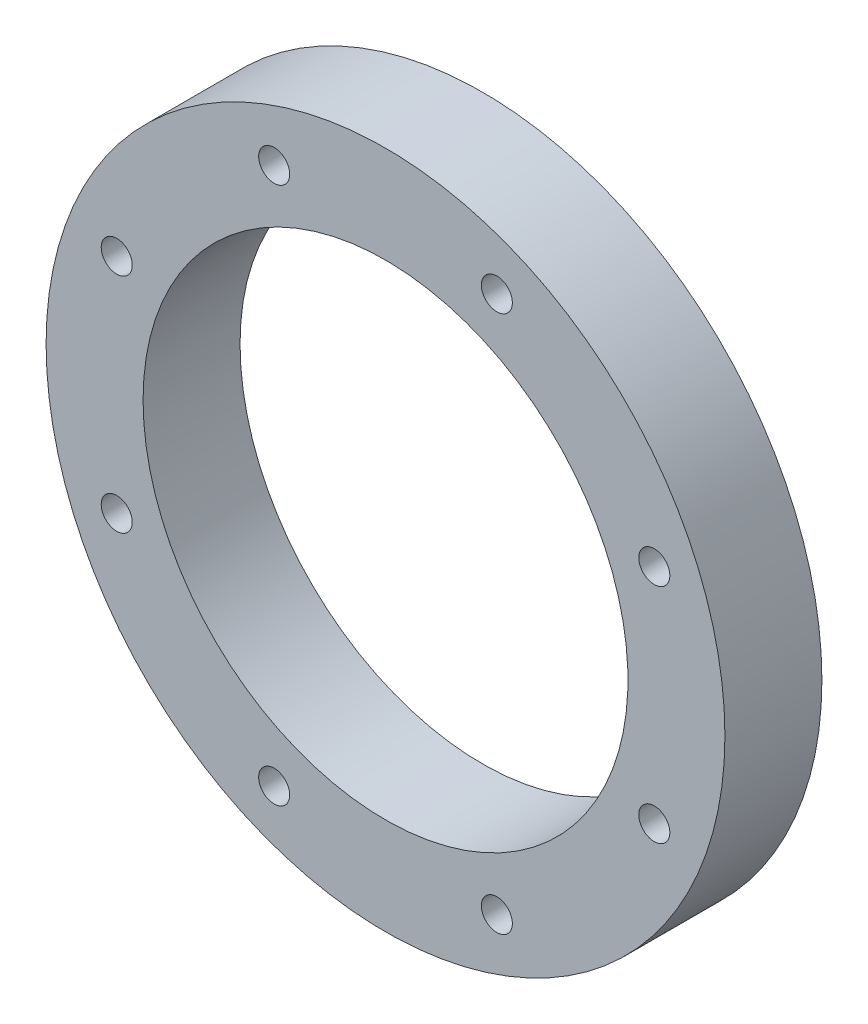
ISO-10303-21;
HEADER;
FILE_DESCRIPTION(('STEP AP214'),'2;1');
FILE_NAME('part.step','',(''),(''),'','','');
FILE_SCHEMA(('AUTOMOTIVE_DESIGN { 1 0 10303 214 1 1 1 1 }'));
ENDSEC;
DATA;
#1=APPLICATION_CONTEXT('core data for automotive mechanical design processes');
#2=APPLICATION_PROTOCOL_DEFINITION('international standard','automotive_design',2000,#1);
#3=PRODUCT_CONTEXT('',#1,'mechanical');
#4=PRODUCT('Part','Part','',(#3));
#5=PRODUCT_RELATED_PRODUCT_CATEGORY('part','',(#4));
#6=PRODUCT_DEFINITION_FORMATION('','',#4);
#7=PRODUCT_DEFINITION_CONTEXT('part definition',#1,'design');
#8=PRODUCT_DEFINITION('design','',#6,#7);
#9=PRODUCT_DEFINITION_SHAPE('','',#8);
#10=(LENGTH_UNIT() NAMED_UNIT(*) SI_UNIT(.MILLI.,.METRE.));
#11=(NAMED_UNIT(*) PLANE_ANGLE_UNIT() SI_UNIT($,.RADIAN.));
#12=(NAMED_UNIT(*) SI_UNIT($,.STERADIAN.) SOLID_ANGLE_UNIT());
#13=UNCERTAINTY_MEASURE_WITH_UNIT(LENGTH_MEASURE(1.E-05),#10,'distance_accuracy_value','');
#14=(GEOMETRIC_REPRESENTATION_CONTEXT(3) GLOBAL_UNCERTAINTY_ASSIGNED_CONTEXT((#13)) GLOBAL_UNIT_ASSIGNED_CONTEXT((#10,
#11,#12)) REPRESENTATION_CONTEXT('',''));
#15=CARTESIAN_POINT('',(0.,0.,0.));
#16=DIRECTION('',(0.,0.,1.));
#17=DIRECTION('',(1.,0.,0.));
#18=AXIS2_PLACEMENT_3D('',#15,#16,#17);
#19=CARTESIAN_POINT('',(0.,0.,-10.));
#20=DIRECTION('',(0.,0.,1.));
#21=DIRECTION('',(1.,0.,0.));
#22=AXIS2_PLACEMENT_3D('',#19,#20,#21);
#23=PLANE('',#22);
#24=CARTESIAN_POINT('',(-27.7163872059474,-11.4804999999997,-10.));
#25=DIRECTION('',(0.,0.,-1.));
#26=DIRECTION('',(-1.,0.,0.));
#27=AXIS2_PLACEMENT_3D('',#24,#25,#26);
#28=CIRCLE('',#27,3.25);
#29=CARTESIAN_POINT('',(-30.9663872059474,-11.4804999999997,-10.));
#30=VERTEX_POINT('',#29);
#31=EDGE_CURVE('E131',#30,#30,#28,.T.);
#32=ORIENTED_EDGE('',*,*,#31,.F.);
#33=EDGE_LOOP('',(#32));
#34=FACE_BOUND('',#33,.T.);
#35=CARTESIAN_POINT('',(-11.4805059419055,-27.7163847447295,-10.));
#36=DIRECTION('',(0.,0.,-1.));
#37=DIRECTION('',(-1.,0.,0.));
#38=AXIS2_PLACEMENT_3D('',#35,#36,#37);
#39=CIRCLE('',#38,3.25);
#40=CARTESIAN_POINT('',(-14.7305059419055,-27.7163847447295,-10.));
#41=VERTEX_POINT('',#40);
#42=EDGE_CURVE('E119',#41,#41,#39,.T.);
#43=ORIENTED_EDGE('',*,*,#42,.F.);
#44=EDGE_LOOP('',(#43));
#45=FACE_BOUND('',#44,.T.);
#46=CARTESIAN_POINT('',(11.4805,-27.7163872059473,-10.));
#47=DIRECTION('',(0.,0.,-1.));
#48=DIRECTION('',(-1.,0.,0.));
#49=AXIS2_PLACEMENT_3D('',#46,#47,#48);
#50=CIRCLE('',#49,3.25);
#51=CARTESIAN_POINT('',(8.2305,-27.7163872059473,-10.));
#52=VERTEX_POINT('',#51);
#53=EDGE_CURVE('E107',#52,#52,#50,.T.);
#54=ORIENTED_EDGE('',*,*,#53,.F.);
#55=EDGE_LOOP('',(#54));
#56=FACE_BOUND('',#55,.T.);
#57=CARTESIAN_POINT('',(27.7163847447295,-11.4805059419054,-10.));
#58=DIRECTION('',(0.,0.,-1.));
#59=DIRECTION('',(-1.,0.,0.));
#60=AXIS2_PLACEMENT_3D('',#57,#58,#59);
#61=CIRCLE('',#60,3.25);
#62=CARTESIAN_POINT('',(24.4663847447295,-11.4805059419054,-10.));
#63=VERTEX_POINT('',#62);
#64=EDGE_CURVE('E95',#63,#63,#61,.T.);
#65=ORIENTED_EDGE('',*,*,#64,.F.);
#66=EDGE_LOOP('',(#65));
#67=FACE_BOUND('',#66,.T.);
#68=CARTESIAN_POINT('',(27.7163872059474,11.4804999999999,-10.));
#69=DIRECTION('',(0.,0.,-1.));
#70=DIRECTION('',(-1.,0.,0.));
#71=AXIS2_PLACEMENT_3D('',#68,#69,#70);
#72=CIRCLE('',#71,3.25);
#73=CARTESIAN_POINT('',(24.4663872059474,11.4804999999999,-10.));
#74=VERTEX_POINT('',#73);
#75=EDGE_CURVE('E83',#74,#74,#72,.T.);
#76=ORIENTED_EDGE('',*,*,#75,.F.);
#77=EDGE_LOOP('',(#76));
#78=FACE_BOUND('',#77,.T.);
#79=CARTESIAN_POINT('',(11.4805059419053,27.7163847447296,-10.));
#80=DIRECTION('',(0.,0.,-1.));
#81=DIRECTION('',(-1.,0.,0.));
#82=AXIS2_PLACEMENT_3D('',#79,#80,#81);
#83=CIRCLE('',#82,3.25);
#84=CARTESIAN_POINT('',(8.23050594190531,27.7163847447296,-10.));
#85=VERTEX_POINT('',#84);
#86=EDGE_CURVE('E71',#85,#85,#83,.T.);
#87=ORIENTED_EDGE('',*,*,#86,.F.);
#88=EDGE_LOOP('',(#87));
#89=FACE_BOUND('',#88,.T.);
#90=CARTESIAN_POINT('',(-11.4805,27.7163872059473,-10.));
#91=DIRECTION('',(0.,0.,-1.));
#92=DIRECTION('',(-1.,0.,0.));
#93=AXIS2_PLACEMENT_3D('',#90,#91,#92);
#94=CIRCLE('',#93,3.25);
#95=CARTESIAN_POINT('',(-14.7305,27.7163872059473,-10.));
#96=VERTEX_POINT('',#95);
#97=EDGE_CURVE('E59',#96,#96,#94,.T.);
#98=ORIENTED_EDGE('',*,*,#97,.F.);
#99=EDGE_LOOP('',(#98));
#100=FACE_BOUND('',#99,.T.);
#101=CARTESIAN_POINT('',(0.,0.,-10.));
#102=DIRECTION('',(0.,0.,-1.));
#103=DIRECTION('',(-1.,0.,0.));
#104=AXIS2_PLACEMENT_3D('',#101,#102,#103);
#105=CIRCLE('',#104,25.);
#106=CARTESIAN_POINT('',(-25.,0.,-10.));
#107=VERTEX_POINT('',#106);
#108=EDGE_CURVE('E45',#107,#107,#105,.T.);
#109=ORIENTED_EDGE('',*,*,#108,.F.);
#110=EDGE_LOOP('',(#109));
#111=FACE_BOUND('',#110,.T.);
#112=CARTESIAN_POINT('',(0.,0.,-10.));
#113=DIRECTION('',(0.,0.,1.));
#114=DIRECTION('',(1.,0.,0.));
#115=AXIS2_PLACEMENT_3D('',#112,#113,#114);
#116=CIRCLE('',#115,35.);
#117=CARTESIAN_POINT('',(35.,0.,-10.));
#118=VERTEX_POINT('',#117);
#119=EDGE_CURVE('E10',#118,#118,#116,.T.);
#120=ORIENTED_EDGE('',*,*,#119,.F.);
#121=EDGE_LOOP('',(#120));
#122=FACE_BOUND('',#121,.T.);
#123=CARTESIAN_POINT('',(-27.7163847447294,11.4805059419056,-10.));
#124=DIRECTION('',(0.,0.,-1.));
#125=DIRECTION('',(-1.,0.,0.));
#126=AXIS2_PLACEMENT_3D('',#123,#124,#125);
#127=CIRCLE('',#126,3.25);
#128=CARTESIAN_POINT('',(-30.9663847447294,11.4805059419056,-10.));
#129=VERTEX_POINT('',#128);
#130=EDGE_CURVE('E143',#129,#129,#127,.T.);
#131=ORIENTED_EDGE('',*,*,#130,.F.);
#132=EDGE_LOOP('',(#131));
#133=FACE_BOUND('',#132,.T.);
#134=ADVANCED_FACE('F32',(#34,#45,#56,#67,#78,#89,#100,#111,#122,#133),#23,.F.);
#135=CARTESIAN_POINT('',(0.,0.,-10.));
#136=DIRECTION('',(0.,0.,1.));
#137=DIRECTION('',(1.,0.,0.));
#138=AXIS2_PLACEMENT_3D('',#135,#136,#137);
#139=CYLINDRICAL_SURFACE('',#138,35.);
#140=ORIENTED_EDGE('',*,*,#119,.T.);
#141=EDGE_LOOP('',(#140));
#142=FACE_BOUND('',#141,.T.);
#143=CARTESIAN_POINT('',(0.,0.,0.));
#144=DIRECTION('',(0.,0.,1.));
#145=DIRECTION('',(1.,0.,0.));
#146=AXIS2_PLACEMENT_3D('',#143,#144,#145);
#147=CIRCLE('',#146,35.);
#148=CARTESIAN_POINT('',(35.,0.,0.));
#149=VERTEX_POINT('',#148);
#150=EDGE_CURVE('E36',#149,#149,#147,.T.);
#151=ORIENTED_EDGE('',*,*,#150,.F.);
#152=EDGE_LOOP('',(#151));
#153=FACE_BOUND('',#152,.T.);
#154=ADVANCED_FACE('F34',(#142,#153),#139,.T.);
#155=CARTESIAN_POINT('',(0.,0.,0.));
#156=DIRECTION('',(0.,0.,1.));
#157=DIRECTION('',(1.,0.,0.));
#158=AXIS2_PLACEMENT_3D('',#155,#156,#157);
#159=PLANE('',#158);
#160=CARTESIAN_POINT('',(-27.7163847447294,11.4805059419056,0.));
#161=DIRECTION('',(0.,0.,-1.));
#162=DIRECTION('',(-1.,0.,0.));
#163=AXIS2_PLACEMENT_3D('',#160,#161,#162);
#164=CIRCLE('',#163,1.6);
#165=CARTESIAN_POINT('',(-29.3163847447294,11.4805059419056,0.));
#166=VERTEX_POINT('',#165);
#167=EDGE_CURVE('E134',#166,#166,#164,.T.);
#168=ORIENTED_EDGE('',*,*,#167,.T.);
#169=EDGE_LOOP('',(#168));
#170=FACE_BOUND('',#169,.T.);
#171=CARTESIAN_POINT('',(-27.7163872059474,-11.4804999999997,0.));
#172=DIRECTION('',(0.,0.,-1.));
#173=DIRECTION('',(-1.,0.,0.));
#174=AXIS2_PLACEMENT_3D('',#171,#172,#173);
#175=CIRCLE('',#174,1.6);
#176=CARTESIAN_POINT('',(-29.3163872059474,-11.4804999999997,0.));
#177=VERTEX_POINT('',#176);
#178=EDGE_CURVE('E122',#177,#177,#175,.T.);
#179=ORIENTED_EDGE('',*,*,#178,.T.);
#180=EDGE_LOOP('',(#179));
#181=FACE_BOUND('',#180,.T.);
#182=CARTESIAN_POINT('',(-11.4805059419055,-27.7163847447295,0.));
#183=DIRECTION('',(0.,0.,-1.));
#184=DIRECTION('',(-1.,0.,0.));
#185=AXIS2_PLACEMENT_3D('',#182,#183,#184);
#186=CIRCLE('',#185,1.6);
#187=CARTESIAN_POINT('',(-13.0805059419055,-27.7163847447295,0.));
#188=VERTEX_POINT('',#187);
#189=EDGE_CURVE('E110',#188,#188,#186,.T.);
#190=ORIENTED_EDGE('',*,*,#189,.T.);
#191=EDGE_LOOP('',(#190));
#192=FACE_BOUND('',#191,.T.);
#193=CARTESIAN_POINT('',(11.4805,-27.7163872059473,0.));
#194=DIRECTION('',(0.,0.,-1.));
#195=DIRECTION('',(-1.,0.,0.));
#196=AXIS2_PLACEMENT_3D('',#193,#194,#195);
#197=CIRCLE('',#196,1.6);
#198=CARTESIAN_POINT('',(9.8805,-27.7163872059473,0.));
#199=VERTEX_POINT('',#198);
#200=EDGE_CURVE('E98',#199,#199,#197,.T.);
#201=ORIENTED_EDGE('',*,*,#200,.T.);
#202=EDGE_LOOP('',(#201));
#203=FACE_BOUND('',#202,.T.);
#204=CARTESIAN_POINT('',(27.7163847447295,-11.4805059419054,0.));
#205=DIRECTION('',(0.,0.,-1.));
#206=DIRECTION('',(-1.,0.,0.));
#207=AXIS2_PLACEMENT_3D('',#204,#205,#206);
#208=CIRCLE('',#207,1.6);
#209=CARTESIAN_POINT('',(26.1163847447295,-11.4805059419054,0.));
#210=VERTEX_POINT('',#209);
#211=EDGE_CURVE('E86',#210,#210,#208,.T.);
#212=ORIENTED_EDGE('',*,*,#211,.T.);
#213=EDGE_LOOP('',(#212));
#214=FACE_BOUND('',#213,.T.);
#215=CARTESIAN_POINT('',(27.7163872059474,11.4804999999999,0.));
#216=DIRECTION('',(0.,0.,-1.));
#217=DIRECTION('',(-1.,0.,0.));
#218=AXIS2_PLACEMENT_3D('',#215,#216,#217);
#219=CIRCLE('',#218,1.6);
#220=CARTESIAN_POINT('',(26.1163872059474,11.4804999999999,0.));
#221=VERTEX_POINT('',#220);
#222=EDGE_CURVE('E74',#221,#221,#219,.T.);
#223=ORIENTED_EDGE('',*,*,#222,.T.);
#224=EDGE_LOOP('',(#223));
#225=FACE_BOUND('',#224,.T.);
#226=CARTESIAN_POINT('',(11.4805059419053,27.7163847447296,0.));
#227=DIRECTION('',(0.,0.,-1.));
#228=DIRECTION('',(-1.,0.,0.));
#229=AXIS2_PLACEMENT_3D('',#226,#227,#228);
#230=CIRCLE('',#229,1.6);
#231=CARTESIAN_POINT('',(9.88050594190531,27.7163847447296,0.));
#232=VERTEX_POINT('',#231);
#233=EDGE_CURVE('E62',#232,#232,#230,.T.);
#234=ORIENTED_EDGE('',*,*,#233,.T.);
#235=EDGE_LOOP('',(#234));
#236=FACE_BOUND('',#235,.T.);
#237=CARTESIAN_POINT('',(-11.4805,27.7163872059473,0.));
#238=DIRECTION('',(0.,0.,-1.));
#239=DIRECTION('',(-1.,0.,0.));
#240=AXIS2_PLACEMENT_3D('',#237,#238,#239);
#241=CIRCLE('',#240,1.6);
#242=CARTESIAN_POINT('',(-13.0805,27.7163872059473,0.));
#243=VERTEX_POINT('',#242);
#244=EDGE_CURVE('E48',#243,#243,#241,.T.);
#245=ORIENTED_EDGE('',*,*,#244,.T.);
#246=EDGE_LOOP('',(#245));
#247=FACE_BOUND('',#246,.T.);
#248=CARTESIAN_POINT('',(0.,0.,0.));
#249=DIRECTION('',(0.,0.,-1.));
#250=DIRECTION('',(-1.,0.,0.));
#251=AXIS2_PLACEMENT_3D('',#248,#249,#250);
#252=CIRCLE('',#251,25.);
#253=CARTESIAN_POINT('',(-25.,0.,0.));
#254=VERTEX_POINT('',#253);
#255=EDGE_CURVE('E43',#254,#254,#252,.T.);
#256=ORIENTED_EDGE('',*,*,#255,.T.);
#257=EDGE_LOOP('',(#256));
#258=FACE_BOUND('',#257,.T.);
#259=ORIENTED_EDGE('',*,*,#150,.T.);
#260=EDGE_LOOP('',(#259));
#261=FACE_BOUND('',#260,.T.);
#262=ADVANCED_FACE('F155',(#170,#181,#192,#203,#214,#225,#236,#247,#258,#261),#159,.T.);
#263=CARTESIAN_POINT('',(0.,0.,0.));
#264=DIRECTION('',(0.,0.,-1.));
#265=DIRECTION('',(-1.,0.,0.));
#266=AXIS2_PLACEMENT_3D('',#263,#264,#265);
#267=CYLINDRICAL_SURFACE('',#266,25.);
#268=ORIENTED_EDGE('',*,*,#255,.F.);
#269=EDGE_LOOP('',(#268));
#270=FACE_BOUND('',#269,.T.);
#271=ORIENTED_EDGE('',*,*,#108,.T.);
#272=EDGE_LOOP('',(#271));
#273=FACE_BOUND('',#272,.T.);
#274=ADVANCED_FACE('F159',(#270,#273),#267,.F.);
#275=CARTESIAN_POINT('',(-11.4805,27.7163872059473,-10.));
#276=DIRECTION('',(0.,0.,-1.));
#277=DIRECTION('',(-1.,0.,0.));
#278=AXIS2_PLACEMENT_3D('',#275,#276,#277);
#279=CYLINDRICAL_SURFACE('',#278,1.60000000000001);
#280=ORIENTED_EDGE('',*,*,#244,.F.);
#281=EDGE_LOOP('',(#280));
#282=FACE_BOUND('',#281,.T.);
#283=CARTESIAN_POINT('',(-11.4805,27.7163872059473,-6.));
#284=DIRECTION('',(0.,0.,-1.));
#285=DIRECTION('',(-1.,0.,0.));
#286=AXIS2_PLACEMENT_3D('',#283,#284,#285);
#287=CIRCLE('',#286,1.60000000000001);
#288=CARTESIAN_POINT('',(-13.0805,27.7163872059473,-6.));
#289=VERTEX_POINT('',#288);
#290=EDGE_CURVE('E53',#289,#289,#287,.T.);
#291=ORIENTED_EDGE('',*,*,#290,.T.);
#292=EDGE_LOOP('',(#291));
#293=FACE_BOUND('',#292,.T.);
#294=ADVANCED_FACE('F166',(#282,#293),#279,.F.);
#295=CARTESIAN_POINT('',(-9.88049999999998,27.7163872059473,-6.));
#296=DIRECTION('',(0.,0.,1.));
#297=DIRECTION('',(1.,0.,0.));
#298=AXIS2_PLACEMENT_3D('',#295,#296,#297);
#299=PLANE('',#298);
#300=ORIENTED_EDGE('',*,*,#290,.F.);
#301=EDGE_LOOP('',(#300));
#302=FACE_BOUND('',#301,.T.);
#303=CARTESIAN_POINT('',(-11.4805,27.7163872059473,-6.));
#304=DIRECTION('',(0.,0.,-1.));
#305=DIRECTION('',(-1.,0.,0.));
#306=AXIS2_PLACEMENT_3D('',#303,#304,#305);
#307=CIRCLE('',#306,3.25);
#308=CARTESIAN_POINT('',(-14.7305,27.7163872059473,-6.));
#309=VERTEX_POINT('',#308);
#310=EDGE_CURVE('E56',#309,#309,#307,.T.);
#311=ORIENTED_EDGE('',*,*,#310,.T.);
#312=EDGE_LOOP('',(#311));
#313=FACE_BOUND('',#312,.T.);
#314=ADVANCED_FACE('F195',(#302,#313),#299,.F.);
#315=CARTESIAN_POINT('',(-11.4805,27.7163872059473,-10.));
#316=DIRECTION('',(0.,0.,-1.));
#317=DIRECTION('',(-1.,0.,0.));
#318=AXIS2_PLACEMENT_3D('',#315,#316,#317);
#319=CYLINDRICAL_SURFACE('',#318,3.25);
#320=ORIENTED_EDGE('',*,*,#310,.F.);
#321=EDGE_LOOP('',(#320));
#322=FACE_BOUND('',#321,.T.);
#323=ORIENTED_EDGE('',*,*,#97,.T.);
#324=EDGE_LOOP('',(#323));
#325=FACE_BOUND('',#324,.T.);
#326=ADVANCED_FACE('F200',(#322,#325),#319,.F.);
#327=CARTESIAN_POINT('',(11.4805059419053,27.7163847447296,-10.));
#328=DIRECTION('',(0.,0.,-1.));
#329=DIRECTION('',(-1.,0.,0.));
#330=AXIS2_PLACEMENT_3D('',#327,#328,#329);
#331=CYLINDRICAL_SURFACE('',#330,1.60000000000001);
#332=ORIENTED_EDGE('',*,*,#233,.F.);
#333=EDGE_LOOP('',(#332));
#334=FACE_BOUND('',#333,.T.);
#335=CARTESIAN_POINT('',(11.4805059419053,27.7163847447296,-6.));
#336=DIRECTION('',(0.,0.,-1.));
#337=DIRECTION('',(-1.,0.,0.));
#338=AXIS2_PLACEMENT_3D('',#335,#336,#337);
#339=CIRCLE('',#338,1.60000000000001);
#340=CARTESIAN_POINT('',(9.88050594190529,27.7163847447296,-6.));
#341=VERTEX_POINT('',#340);
#342=EDGE_CURVE('E65',#341,#341,#339,.T.);
#343=ORIENTED_EDGE('',*,*,#342,.T.);
#344=EDGE_LOOP('',(#343));
#345=FACE_BOUND('',#344,.T.);
#346=ADVANCED_FACE('F206',(#334,#345),#331,.F.);
#347=CARTESIAN_POINT('',(13.0805059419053,27.7163847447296,-6.));
#348=DIRECTION('',(0.,0.,1.));
#349=DIRECTION('',(1.,0.,0.));
#350=AXIS2_PLACEMENT_3D('',#347,#348,#349);
#351=PLANE('',#350);
#352=ORIENTED_EDGE('',*,*,#342,.F.);
#353=EDGE_LOOP('',(#352));
#354=FACE_BOUND('',#353,.T.);
#355=CARTESIAN_POINT('',(11.4805059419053,27.7163847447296,-6.));
#356=DIRECTION('',(0.,0.,-1.));
#357=DIRECTION('',(-1.,0.,0.));
#358=AXIS2_PLACEMENT_3D('',#355,#356,#357);
#359=CIRCLE('',#358,3.25);
#360=CARTESIAN_POINT('',(8.23050594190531,27.7163847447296,-6.));
#361=VERTEX_POINT('',#360);
#362=EDGE_CURVE('E68',#361,#361,#359,.T.);
#363=ORIENTED_EDGE('',*,*,#362,.T.);
#364=EDGE_LOOP('',(#363));
#365=FACE_BOUND('',#364,.T.);
#366=ADVANCED_FACE('F213',(#354,#365),#351,.F.);
#367=CARTESIAN_POINT('',(11.4805059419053,27.7163847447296,-10.));
#368=DIRECTION('',(0.,0.,-1.));
#369=DIRECTION('',(-1.,0.,0.));
#370=AXIS2_PLACEMENT_3D('',#367,#368,#369);
#371=CYLINDRICAL_SURFACE('',#370,3.25);
#372=ORIENTED_EDGE('',*,*,#362,.F.);
#373=EDGE_LOOP('',(#372));
#374=FACE_BOUND('',#373,.T.);
#375=ORIENTED_EDGE('',*,*,#86,.T.);
#376=EDGE_LOOP('',(#375));
#377=FACE_BOUND('',#376,.T.);
#378=ADVANCED_FACE('F219',(#374,#377),#371,.F.);
#379=CARTESIAN_POINT('',(27.7163872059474,11.4804999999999,-10.));
#380=DIRECTION('',(0.,0.,-1.));
#381=DIRECTION('',(-1.,0.,0.));
#382=AXIS2_PLACEMENT_3D('',#379,#380,#381);
#383=CYLINDRICAL_SURFACE('',#382,1.60000000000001);
#384=ORIENTED_EDGE('',*,*,#222,.F.);
#385=EDGE_LOOP('',(#384));
#386=FACE_BOUND('',#385,.T.);
#387=CARTESIAN_POINT('',(27.7163872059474,11.4804999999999,-6.));
#388=DIRECTION('',(0.,0.,-1.));
#389=DIRECTION('',(-1.,0.,0.));
#390=AXIS2_PLACEMENT_3D('',#387,#388,#389);
#391=CIRCLE('',#390,1.60000000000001);
#392=CARTESIAN_POINT('',(26.1163872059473,11.4804999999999,-6.));
#393=VERTEX_POINT('',#392);
#394=EDGE_CURVE('E77',#393,#393,#391,.T.);
#395=ORIENTED_EDGE('',*,*,#394,.T.);
#396=EDGE_LOOP('',(#395));
#397=FACE_BOUND('',#396,.T.);
#398=ADVANCED_FACE('F223',(#386,#397),#383,.F.);
#399=CARTESIAN_POINT('',(29.3163872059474,11.4804999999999,-6.));
#400=DIRECTION('',(0.,0.,1.));
#401=DIRECTION('',(1.,0.,0.));
#402=AXIS2_PLACEMENT_3D('',#399,#400,#401);
#403=PLANE('',#402);
#404=ORIENTED_EDGE('',*,*,#394,.F.);
#405=EDGE_LOOP('',(#404));
#406=FACE_BOUND('',#405,.T.);
#407=CARTESIAN_POINT('',(27.7163872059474,11.4804999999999,-6.));
#408=DIRECTION('',(0.,0.,-1.));
#409=DIRECTION('',(-1.,0.,0.));
#410=AXIS2_PLACEMENT_3D('',#407,#408,#409);
#411=CIRCLE('',#410,3.25);
#412=CARTESIAN_POINT('',(24.4663872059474,11.4804999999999,-6.));
#413=VERTEX_POINT('',#412);
#414=EDGE_CURVE('E80',#413,#413,#411,.T.);
#415=ORIENTED_EDGE('',*,*,#414,.T.);
#416=EDGE_LOOP('',(#415));
#417=FACE_BOUND('',#416,.T.);
#418=ADVANCED_FACE('F227',(#406,#417),#403,.F.);
#419=CARTESIAN_POINT('',(27.7163872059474,11.4804999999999,-10.));
#420=DIRECTION('',(0.,0.,-1.));
#421=DIRECTION('',(-1.,0.,0.));
#422=AXIS2_PLACEMENT_3D('',#419,#420,#421);
#423=CYLINDRICAL_SURFACE('',#422,3.25);
#424=ORIENTED_EDGE('',*,*,#414,.F.);
#425=EDGE_LOOP('',(#424));
#426=FACE_BOUND('',#425,.T.);
#427=ORIENTED_EDGE('',*,*,#75,.T.);
#428=EDGE_LOOP('',(#427));
#429=FACE_BOUND('',#428,.T.);
#430=ADVANCED_FACE('F231',(#426,#429),#423,.F.);
#431=CARTESIAN_POINT('',(27.7163847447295,-11.4805059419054,-10.));
#432=DIRECTION('',(0.,0.,-1.));
#433=DIRECTION('',(-1.,0.,0.));
#434=AXIS2_PLACEMENT_3D('',#431,#432,#433);
#435=CYLINDRICAL_SURFACE('',#434,1.6);
#436=ORIENTED_EDGE('',*,*,#211,.F.);
#437=EDGE_LOOP('',(#436));
#438=FACE_BOUND('',#437,.T.);
#439=CARTESIAN_POINT('',(27.7163847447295,-11.4805059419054,-6.));
#440=DIRECTION('',(0.,0.,-1.));
#441=DIRECTION('',(-1.,0.,0.));
#442=AXIS2_PLACEMENT_3D('',#439,#440,#441);
#443=CIRCLE('',#442,1.60000000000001);
#444=CARTESIAN_POINT('',(26.1163847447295,-11.4805059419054,-6.));
#445=VERTEX_POINT('',#444);
#446=EDGE_CURVE('E89',#445,#445,#443,.T.);
#447=ORIENTED_EDGE('',*,*,#446,.T.);
#448=EDGE_LOOP('',(#447));
#449=FACE_BOUND('',#448,.T.);
#450=ADVANCED_FACE('F235',(#438,#449),#435,.F.);
#451=CARTESIAN_POINT('',(29.3163847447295,-11.4805059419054,-6.));
#452=DIRECTION('',(0.,0.,1.));
#453=DIRECTION('',(1.,0.,0.));
#454=AXIS2_PLACEMENT_3D('',#451,#452,#453);
#455=PLANE('',#454);
#456=ORIENTED_EDGE('',*,*,#446,.F.);
#457=EDGE_LOOP('',(#456));
#458=FACE_BOUND('',#457,.T.);
#459=CARTESIAN_POINT('',(27.7163847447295,-11.4805059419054,-6.));
#460=DIRECTION('',(0.,0.,-1.));
#461=DIRECTION('',(-1.,0.,0.));
#462=AXIS2_PLACEMENT_3D('',#459,#460,#461);
#463=CIRCLE('',#462,3.25);
#464=CARTESIAN_POINT('',(24.4663847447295,-11.4805059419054,-6.));
#465=VERTEX_POINT('',#464);
#466=EDGE_CURVE('E92',#465,#465,#463,.T.);
#467=ORIENTED_EDGE('',*,*,#466,.T.);
#468=EDGE_LOOP('',(#467));
#469=FACE_BOUND('',#468,.T.);
#470=ADVANCED_FACE('F239',(#458,#469),#455,.F.);
#471=CARTESIAN_POINT('',(27.7163847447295,-11.4805059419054,-10.));
#472=DIRECTION('',(0.,0.,-1.));
#473=DIRECTION('',(-1.,0.,0.));
#474=AXIS2_PLACEMENT_3D('',#471,#472,#473);
#475=CYLINDRICAL_SURFACE('',#474,3.25);
#476=ORIENTED_EDGE('',*,*,#466,.F.);
#477=EDGE_LOOP('',(#476));
#478=FACE_BOUND('',#477,.T.);
#479=ORIENTED_EDGE('',*,*,#64,.T.);
#480=EDGE_LOOP('',(#479));
#481=FACE_BOUND('',#480,.T.);
#482=ADVANCED_FACE('F243',(#478,#481),#475,.F.);
#483=CARTESIAN_POINT('',(11.4805,-27.7163872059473,-10.));
#484=DIRECTION('',(0.,0.,-1.));
#485=DIRECTION('',(-1.,0.,0.));
#486=AXIS2_PLACEMENT_3D('',#483,#484,#485);
#487=CYLINDRICAL_SURFACE('',#486,1.60000000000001);
#488=ORIENTED_EDGE('',*,*,#200,.F.);
#489=EDGE_LOOP('',(#488));
#490=FACE_BOUND('',#489,.T.);
#491=CARTESIAN_POINT('',(11.4805,-27.7163872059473,-6.));
#492=DIRECTION('',(0.,0.,-1.));
#493=DIRECTION('',(-1.,0.,0.));
#494=AXIS2_PLACEMENT_3D('',#491,#492,#493);
#495=CIRCLE('',#494,1.60000000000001);
#496=CARTESIAN_POINT('',(9.88049999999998,-27.7163872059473,-6.));
#497=VERTEX_POINT('',#496);
#498=EDGE_CURVE('E101',#497,#497,#495,.T.);
#499=ORIENTED_EDGE('',*,*,#498,.T.);
#500=EDGE_LOOP('',(#499));
#501=FACE_BOUND('',#500,.T.);
#502=ADVANCED_FACE('F247',(#490,#501),#487,.F.);
#503=CARTESIAN_POINT('',(13.0805,-27.7163872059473,-6.));
#504=DIRECTION('',(0.,0.,1.));
#505=DIRECTION('',(1.,0.,0.));
#506=AXIS2_PLACEMENT_3D('',#503,#504,#505);
#507=PLANE('',#506);
#508=ORIENTED_EDGE('',*,*,#498,.F.);
#509=EDGE_LOOP('',(#508));
#510=FACE_BOUND('',#509,.T.);
#511=CARTESIAN_POINT('',(11.4805,-27.7163872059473,-6.));
#512=DIRECTION('',(0.,0.,-1.));
#513=DIRECTION('',(-1.,0.,0.));
#514=AXIS2_PLACEMENT_3D('',#511,#512,#513);
#515=CIRCLE('',#514,3.25);
#516=CARTESIAN_POINT('',(8.2305,-27.7163872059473,-6.));
#517=VERTEX_POINT('',#516);
#518=EDGE_CURVE('E104',#517,#517,#515,.T.);
#519=ORIENTED_EDGE('',*,*,#518,.T.);
#520=EDGE_LOOP('',(#519));
#521=FACE_BOUND('',#520,.T.);
#522=ADVANCED_FACE('F251',(#510,#521),#507,.F.);
#523=CARTESIAN_POINT('',(11.4805,-27.7163872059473,-10.));
#524=DIRECTION('',(0.,0.,-1.));
#525=DIRECTION('',(-1.,0.,0.));
#526=AXIS2_PLACEMENT_3D('',#523,#524,#525);
#527=CYLINDRICAL_SURFACE('',#526,3.25);
#528=ORIENTED_EDGE('',*,*,#518,.F.);
#529=EDGE_LOOP('',(#528));
#530=FACE_BOUND('',#529,.T.);
#531=ORIENTED_EDGE('',*,*,#53,.T.);
#532=EDGE_LOOP('',(#531));
#533=FACE_BOUND('',#532,.T.);
#534=ADVANCED_FACE('F255',(#530,#533),#527,.F.);
#535=CARTESIAN_POINT('',(-11.4805059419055,-27.7163847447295,-10.));
#536=DIRECTION('',(0.,0.,-1.));
#537=DIRECTION('',(-1.,0.,0.));
#538=AXIS2_PLACEMENT_3D('',#535,#536,#537);
#539=CYLINDRICAL_SURFACE('',#538,1.60000000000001);
#540=ORIENTED_EDGE('',*,*,#189,.F.);
#541=EDGE_LOOP('',(#540));
#542=FACE_BOUND('',#541,.T.);
#543=CARTESIAN_POINT('',(-11.4805059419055,-27.7163847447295,-6.));
#544=DIRECTION('',(0.,0.,-1.));
#545=DIRECTION('',(-1.,0.,0.));
#546=AXIS2_PLACEMENT_3D('',#543,#544,#545);
#547=CIRCLE('',#546,1.60000000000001);
#548=CARTESIAN_POINT('',(-13.0805059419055,-27.7163847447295,-6.));
#549=VERTEX_POINT('',#548);
#550=EDGE_CURVE('E113',#549,#549,#547,.T.);
#551=ORIENTED_EDGE('',*,*,#550,.T.);
#552=EDGE_LOOP('',(#551));
#553=FACE_BOUND('',#552,.T.);
#554=ADVANCED_FACE('F259',(#542,#553),#539,.F.);
#555=CARTESIAN_POINT('',(-9.88050594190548,-27.7163847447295,-6.));
#556=DIRECTION('',(0.,0.,1.));
#557=DIRECTION('',(1.,0.,0.));
#558=AXIS2_PLACEMENT_3D('',#555,#556,#557);
#559=PLANE('',#558);
#560=ORIENTED_EDGE('',*,*,#550,.F.);
#561=EDGE_LOOP('',(#560));
#562=FACE_BOUND('',#561,.T.);
#563=CARTESIAN_POINT('',(-11.4805059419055,-27.7163847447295,-6.));
#564=DIRECTION('',(0.,0.,-1.));
#565=DIRECTION('',(-1.,0.,0.));
#566=AXIS2_PLACEMENT_3D('',#563,#564,#565);
#567=CIRCLE('',#566,3.25);
#568=CARTESIAN_POINT('',(-14.7305059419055,-27.7163847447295,-6.));
#569=VERTEX_POINT('',#568);
#570=EDGE_CURVE('E116',#569,#569,#567,.T.);
#571=ORIENTED_EDGE('',*,*,#570,.T.);
#572=EDGE_LOOP('',(#571));
#573=FACE_BOUND('',#572,.T.);
#574=ADVANCED_FACE('F263',(#562,#573),#559,.F.);
#575=CARTESIAN_POINT('',(-11.4805059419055,-27.7163847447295,-10.));
#576=DIRECTION('',(0.,0.,-1.));
#577=DIRECTION('',(-1.,0.,0.));
#578=AXIS2_PLACEMENT_3D('',#575,#576,#577);
#579=CYLINDRICAL_SURFACE('',#578,3.25);
#580=ORIENTED_EDGE('',*,*,#570,.F.);
#581=EDGE_LOOP('',(#580));
#582=FACE_BOUND('',#581,.T.);
#583=ORIENTED_EDGE('',*,*,#42,.T.);
#584=EDGE_LOOP('',(#583));
#585=FACE_BOUND('',#584,.T.);
#586=ADVANCED_FACE('F267',(#582,#585),#579,.F.);
#587=CARTESIAN_POINT('',(-27.7163872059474,-11.4804999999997,-10.));
#588=DIRECTION('',(0.,0.,-1.));
#589=DIRECTION('',(-1.,0.,0.));
#590=AXIS2_PLACEMENT_3D('',#587,#588,#589);
#591=CYLINDRICAL_SURFACE('',#590,1.6);
#592=ORIENTED_EDGE('',*,*,#178,.F.);
#593=EDGE_LOOP('',(#592));
#594=FACE_BOUND('',#593,.T.);
#595=CARTESIAN_POINT('',(-27.7163872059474,-11.4804999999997,-6.));
#596=DIRECTION('',(0.,0.,-1.));
#597=DIRECTION('',(-1.,0.,0.));
#598=AXIS2_PLACEMENT_3D('',#595,#596,#597);
#599=CIRCLE('',#598,1.60000000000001);
#600=CARTESIAN_POINT('',(-29.3163872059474,-11.4804999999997,-6.));
#601=VERTEX_POINT('',#600);
#602=EDGE_CURVE('E125',#601,#601,#599,.T.);
#603=ORIENTED_EDGE('',*,*,#602,.T.);
#604=EDGE_LOOP('',(#603));
#605=FACE_BOUND('',#604,.T.);
#606=ADVANCED_FACE('F271',(#594,#605),#591,.F.);
#607=CARTESIAN_POINT('',(-26.1163872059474,-11.4804999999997,-6.));
#608=DIRECTION('',(0.,0.,1.));
#609=DIRECTION('',(1.,0.,0.));
#610=AXIS2_PLACEMENT_3D('',#607,#608,#609);
#611=PLANE('',#610);
#612=ORIENTED_EDGE('',*,*,#602,.F.);
#613=EDGE_LOOP('',(#612));
#614=FACE_BOUND('',#613,.T.);
#615=CARTESIAN_POINT('',(-27.7163872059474,-11.4804999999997,-6.));
#616=DIRECTION('',(0.,0.,-1.));
#617=DIRECTION('',(-1.,0.,0.));
#618=AXIS2_PLACEMENT_3D('',#615,#616,#617);
#619=CIRCLE('',#618,3.25);
#620=CARTESIAN_POINT('',(-30.9663872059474,-11.4804999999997,-6.));
#621=VERTEX_POINT('',#620);
#622=EDGE_CURVE('E128',#621,#621,#619,.T.);
#623=ORIENTED_EDGE('',*,*,#622,.T.);
#624=EDGE_LOOP('',(#623));
#625=FACE_BOUND('',#624,.T.);
#626=ADVANCED_FACE('F275',(#614,#625),#611,.F.);
#627=CARTESIAN_POINT('',(-27.7163872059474,-11.4804999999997,-10.));
#628=DIRECTION('',(0.,0.,-1.));
#629=DIRECTION('',(-1.,0.,0.));
#630=AXIS2_PLACEMENT_3D('',#627,#628,#629);
#631=CYLINDRICAL_SURFACE('',#630,3.25);
#632=ORIENTED_EDGE('',*,*,#622,.F.);
#633=EDGE_LOOP('',(#632));
#634=FACE_BOUND('',#633,.T.);
#635=ORIENTED_EDGE('',*,*,#31,.T.);
#636=EDGE_LOOP('',(#635));
#637=FACE_BOUND('',#636,.T.);
#638=ADVANCED_FACE('F279',(#634,#637),#631,.F.);
#639=CARTESIAN_POINT('',(-27.7163847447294,11.4805059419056,-10.));
#640=DIRECTION('',(0.,0.,-1.));
#641=DIRECTION('',(-1.,0.,0.));
#642=AXIS2_PLACEMENT_3D('',#639,#640,#641);
#643=CYLINDRICAL_SURFACE('',#642,1.6);
#644=ORIENTED_EDGE('',*,*,#167,.F.);
#645=EDGE_LOOP('',(#644));
#646=FACE_BOUND('',#645,.T.);
#647=CARTESIAN_POINT('',(-27.7163847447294,11.4805059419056,-6.));
#648=DIRECTION('',(0.,0.,-1.));
#649=DIRECTION('',(-1.,0.,0.));
#650=AXIS2_PLACEMENT_3D('',#647,#648,#649);
#651=CIRCLE('',#650,1.60000000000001);
#652=CARTESIAN_POINT('',(-29.3163847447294,11.4805059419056,-6.));
#653=VERTEX_POINT('',#652);
#654=EDGE_CURVE('E137',#653,#653,#651,.T.);
#655=ORIENTED_EDGE('',*,*,#654,.T.);
#656=EDGE_LOOP('',(#655));
#657=FACE_BOUND('',#656,.T.);
#658=ADVANCED_FACE('F283',(#646,#657),#643,.F.);
#659=CARTESIAN_POINT('',(-26.1163847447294,11.4805059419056,-6.));
#660=DIRECTION('',(0.,0.,1.));
#661=DIRECTION('',(1.,0.,0.));
#662=AXIS2_PLACEMENT_3D('',#659,#660,#661);
#663=PLANE('',#662);
#664=ORIENTED_EDGE('',*,*,#654,.F.);
#665=EDGE_LOOP('',(#664));
#666=FACE_BOUND('',#665,.T.);
#667=CARTESIAN_POINT('',(-27.7163847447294,11.4805059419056,-6.));
#668=DIRECTION('',(0.,0.,-1.));
#669=DIRECTION('',(-1.,0.,0.));
#670=AXIS2_PLACEMENT_3D('',#667,#668,#669);
#671=CIRCLE('',#670,3.25);
#672=CARTESIAN_POINT('',(-30.9663847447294,11.4805059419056,-6.));
#673=VERTEX_POINT('',#672);
#674=EDGE_CURVE('E140',#673,#673,#671,.T.);
#675=ORIENTED_EDGE('',*,*,#674,.T.);
#676=EDGE_LOOP('',(#675));
#677=FACE_BOUND('',#676,.T.);
#678=ADVANCED_FACE('F287',(#666,#677),#663,.F.);
#679=CARTESIAN_POINT('',(-27.7163847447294,11.4805059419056,-10.));
#680=DIRECTION('',(0.,0.,-1.));
#681=DIRECTION('',(-1.,0.,0.));
#682=AXIS2_PLACEMENT_3D('',#679,#680,#681);
#683=CYLINDRICAL_SURFACE('',#682,3.25);
#684=ORIENTED_EDGE('',*,*,#674,.F.);
#685=EDGE_LOOP('',(#684));
#686=FACE_BOUND('',#685,.T.);
#687=ORIENTED_EDGE('',*,*,#130,.T.);
#688=EDGE_LOOP('',(#687));
#689=FACE_BOUND('',#688,.T.);
#690=ADVANCED_FACE('F147',(#686,#689),#683,.F.);
#691=CLOSED_SHELL('',(#134,#154,#262,#274,#294,#314,#326,#346,#366,#378,#398,#418,#430,#450,
#470,#482,#502,#522,#534,#554,#574,#586,#606,#626,#638,#658,#678,#690));
#692=MANIFOLD_SOLID_BREP('B2',#691);
#693=ADVANCED_BREP_SHAPE_REPRESENTATION('',(#18,#692),#14);
#694=SHAPE_DEFINITION_REPRESENTATION(#9,#693);
ENDSEC;
END-ISO-10303-21;
